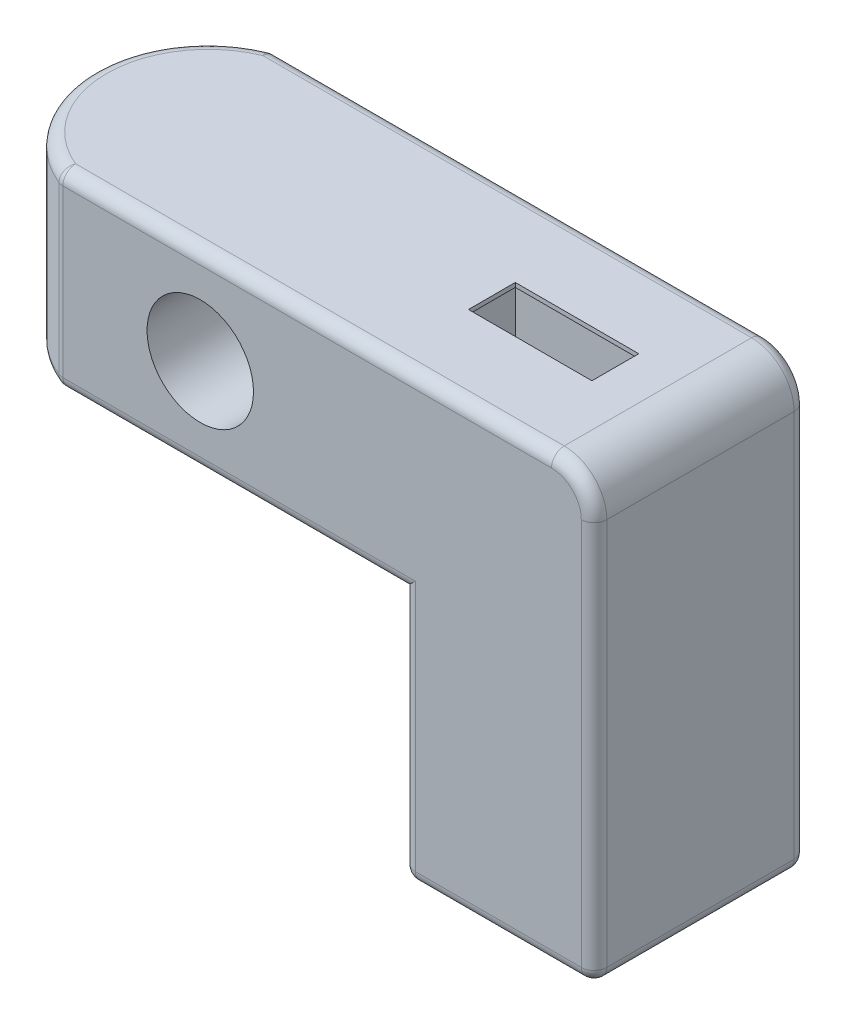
ISO-10303-21;
HEADER;
FILE_DESCRIPTION(('STEP AP214'),'2;1');
FILE_NAME('part.step','',(''),(''),'','','');
FILE_SCHEMA(('AUTOMOTIVE_DESIGN { 1 0 10303 214 1 1 1 1 }'));
ENDSEC;
DATA;
#1=APPLICATION_CONTEXT('core data for automotive mechanical design processes');
#2=APPLICATION_PROTOCOL_DEFINITION('international standard','automotive_design',2000,#1);
#3=PRODUCT_CONTEXT('',#1,'mechanical');
#4=PRODUCT('Part','Part','',(#3));
#5=PRODUCT_RELATED_PRODUCT_CATEGORY('part','',(#4));
#6=PRODUCT_DEFINITION_FORMATION('','',#4);
#7=PRODUCT_DEFINITION_CONTEXT('part definition',#1,'design');
#8=PRODUCT_DEFINITION('design','',#6,#7);
#9=PRODUCT_DEFINITION_SHAPE('','',#8);
#10=(LENGTH_UNIT() NAMED_UNIT(*) SI_UNIT(.MILLI.,.METRE.));
#11=(NAMED_UNIT(*) PLANE_ANGLE_UNIT() SI_UNIT($,.RADIAN.));
#12=(NAMED_UNIT(*) SI_UNIT($,.STERADIAN.) SOLID_ANGLE_UNIT());
#13=UNCERTAINTY_MEASURE_WITH_UNIT(LENGTH_MEASURE(1.E-05),#10,'distance_accuracy_value','');
#14=(GEOMETRIC_REPRESENTATION_CONTEXT(3) GLOBAL_UNCERTAINTY_ASSIGNED_CONTEXT((#13)) GLOBAL_UNIT_ASSIGNED_CONTEXT((#10,
#11,#12)) REPRESENTATION_CONTEXT('',''));
#15=CARTESIAN_POINT('',(0.,0.,0.));
#16=DIRECTION('',(0.,0.,1.));
#17=DIRECTION('',(1.,0.,0.));
#18=AXIS2_PLACEMENT_3D('',#15,#16,#17);
#19=CARTESIAN_POINT('',(-120.,-22.5,-25.));
#20=DIRECTION('',(0.,-1.,0.));
#21=DIRECTION('',(0.,0.,-1.));
#22=AXIS2_PLACEMENT_3D('',#19,#20,#21);
#23=PLANE('',#22);
#24=DIRECTION('',(1.,0.,0.));
#25=VECTOR('',#24,1.);
#26=CARTESIAN_POINT('',(-120.,-22.5,22.));
#27=LINE('',#26,#25);
#28=CARTESIAN_POINT('',(-22.5,-22.5,22.));
#29=VERTEX_POINT('',#28);
#30=CARTESIAN_POINT('',(-102.272161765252,-22.5,22.));
#31=VERTEX_POINT('',#30);
#32=EDGE_CURVE('E423',#29,#31,#27,.F.);
#33=ORIENTED_EDGE('',*,*,#32,.T.);
#34=CARTESIAN_POINT('',(-93.2046130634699,-22.5,0.));
#35=DIRECTION('',(0.,-1.,0.));
#36=DIRECTION('',(0.,0.,-1.));
#37=AXIS2_PLACEMENT_3D('',#34,#35,#36);
#38=CIRCLE('',#37,23.7953869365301);
#39=CARTESIAN_POINT('',(-102.272161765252,-22.5,-22.));
#40=VERTEX_POINT('',#39);
#41=EDGE_CURVE('E528',#31,#40,#38,.T.);
#42=ORIENTED_EDGE('',*,*,#41,.T.);
#43=DIRECTION('',(1.,0.,0.));
#44=VECTOR('',#43,1.);
#45=CARTESIAN_POINT('',(-22.5,-22.5,-22.));
#46=LINE('',#45,#44);
#47=CARTESIAN_POINT('',(-22.5,-22.5,-22.));
#48=VERTEX_POINT('',#47);
#49=EDGE_CURVE('E420',#40,#48,#46,.T.);
#50=ORIENTED_EDGE('',*,*,#49,.T.);
#51=DIRECTION('',(0.,0.,1.));
#52=VECTOR('',#51,1.);
#53=CARTESIAN_POINT('',(-22.5,-22.5,-25.));
#54=LINE('',#53,#52);
#55=EDGE_CURVE('E310',#48,#29,#54,.T.);
#56=ORIENTED_EDGE('',*,*,#55,.T.);
#57=EDGE_LOOP('',(#33,#42,#50,#56));
#58=FACE_BOUND('',#57,.T.);
#59=ADVANCED_FACE('F46',(#58),#23,.T.);
#60=CARTESIAN_POINT('',(22.5,22.5,-25.));
#61=DIRECTION('',(0.,1.,0.));
#62=DIRECTION('',(0.,0.,1.));
#63=AXIS2_PLACEMENT_3D('',#60,#61,#62);
#64=PLANE('',#63);
#65=DIRECTION('',(0.,0.,-1.));
#66=VECTOR('',#65,1.);
#67=CARTESIAN_POINT('',(2.50000000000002,22.5,-5.5));
#68=LINE('',#67,#66);
#69=CARTESIAN_POINT('',(2.50000000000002,22.5,5.5));
#70=VERTEX_POINT('',#69);
#71=CARTESIAN_POINT('',(2.50000000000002,22.5,-5.5));
#72=VERTEX_POINT('',#71);
#73=EDGE_CURVE('E270',#70,#72,#68,.T.);
#74=ORIENTED_EDGE('',*,*,#73,.F.);
#75=DIRECTION('',(1.,0.,0.));
#76=VECTOR('',#75,1.);
#77=CARTESIAN_POINT('',(-26.5,22.5,5.5));
#78=LINE('',#77,#76);
#79=CARTESIAN_POINT('',(-26.5,22.5,5.5));
#80=VERTEX_POINT('',#79);
#81=EDGE_CURVE('E282',#80,#70,#78,.T.);
#82=ORIENTED_EDGE('',*,*,#81,.F.);
#83=DIRECTION('',(0.,0.,1.));
#84=VECTOR('',#83,1.);
#85=CARTESIAN_POINT('',(-26.5,22.5,-5.5));
#86=LINE('',#85,#84);
#87=CARTESIAN_POINT('',(-26.5,22.5,-5.5));
#88=VERTEX_POINT('',#87);
#89=EDGE_CURVE('E278',#88,#80,#86,.T.);
#90=ORIENTED_EDGE('',*,*,#89,.F.);
#91=DIRECTION('',(-1.,0.,0.));
#92=VECTOR('',#91,1.);
#93=CARTESIAN_POINT('',(-26.5,22.5,-5.5));
#94=LINE('',#93,#92);
#95=EDGE_CURVE('E274',#72,#88,#94,.T.);
#96=ORIENTED_EDGE('',*,*,#95,.F.);
#97=EDGE_LOOP('',(#74,#82,#90,#96));
#98=FACE_BOUND('',#97,.T.);
#99=DIRECTION('',(-1.,0.,0.));
#100=VECTOR('',#99,1.);
#101=CARTESIAN_POINT('',(-102.847888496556,22.5,-22.));
#102=LINE('',#101,#100);
#103=CARTESIAN_POINT('',(12.5,22.5,-22.));
#104=VERTEX_POINT('',#103);
#105=CARTESIAN_POINT('',(-102.272161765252,22.5,-22.));
#106=VERTEX_POINT('',#105);
#107=EDGE_CURVE('E430',#104,#106,#102,.T.);
#108=ORIENTED_EDGE('',*,*,#107,.T.);
#109=CARTESIAN_POINT('',(-93.2046130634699,22.5,0.));
#110=DIRECTION('',(0.,1.,0.));
#111=DIRECTION('',(0.,0.,1.));
#112=AXIS2_PLACEMENT_3D('',#109,#110,#111);
#113=CIRCLE('',#112,23.7953869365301);
#114=CARTESIAN_POINT('',(-102.272161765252,22.5,22.));
#115=VERTEX_POINT('',#114);
#116=EDGE_CURVE('E70',#106,#115,#113,.T.);
#117=ORIENTED_EDGE('',*,*,#116,.T.);
#118=DIRECTION('',(-1.,0.,0.));
#119=VECTOR('',#118,1.);
#120=CARTESIAN_POINT('',(22.5,22.5,22.));
#121=LINE('',#120,#119);
#122=CARTESIAN_POINT('',(12.5,22.5,22.));
#123=VERTEX_POINT('',#122);
#124=EDGE_CURVE('E427',#115,#123,#121,.F.);
#125=ORIENTED_EDGE('',*,*,#124,.T.);
#126=DIRECTION('',(0.,0.,1.));
#127=VECTOR('',#126,1.);
#128=CARTESIAN_POINT('',(12.5,22.5,-25.));
#129=LINE('',#128,#127);
#130=EDGE_CURVE('E322',#123,#104,#129,.F.);
#131=ORIENTED_EDGE('',*,*,#130,.T.);
#132=EDGE_LOOP('',(#108,#117,#125,#131));
#133=FACE_BOUND('',#132,.T.);
#134=ADVANCED_FACE('F576',(#98,#133),#64,.T.);
#135=CARTESIAN_POINT('',(-22.5,-22.5,-25.));
#136=DIRECTION('',(-1.,0.,0.));
#137=DIRECTION('',(0.,-1.,0.));
#138=AXIS2_PLACEMENT_3D('',#135,#136,#137);
#139=PLANE('',#138);
#140=DIRECTION('',(0.,0.,1.));
#141=VECTOR('',#140,1.);
#142=CARTESIAN_POINT('',(-22.5,-78.5838135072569,-25.));
#143=LINE('',#142,#141);
#144=CARTESIAN_POINT('',(-22.5,-78.5838135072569,-22.));
#145=VERTEX_POINT('',#144);
#146=CARTESIAN_POINT('',(-22.5,-78.5838135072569,22.));
#147=VERTEX_POINT('',#146);
#148=EDGE_CURVE('E414',#145,#147,#143,.T.);
#149=ORIENTED_EDGE('',*,*,#148,.T.);
#150=DIRECTION('',(0.,-1.,0.));
#151=VECTOR('',#150,1.);
#152=CARTESIAN_POINT('',(-22.5,-22.5,22.));
#153=LINE('',#152,#151);
#154=EDGE_CURVE('E417',#147,#29,#153,.F.);
#155=ORIENTED_EDGE('',*,*,#154,.T.);
#156=ORIENTED_EDGE('',*,*,#55,.F.);
#157=DIRECTION('',(0.,-1.,0.));
#158=VECTOR('',#157,1.);
#159=CARTESIAN_POINT('',(-22.5,-81.5838135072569,-22.));
#160=LINE('',#159,#158);
#161=EDGE_CURVE('E411',#48,#145,#160,.T.);
#162=ORIENTED_EDGE('',*,*,#161,.T.);
#163=EDGE_LOOP('',(#149,#155,#156,#162));
#164=FACE_BOUND('',#163,.T.);
#165=ADVANCED_FACE('F582',(#164),#139,.T.);
#166=CARTESIAN_POINT('',(22.5,-81.5838135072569,-25.));
#167=DIRECTION('',(1.,0.,0.));
#168=DIRECTION('',(0.,0.,-1.));
#169=AXIS2_PLACEMENT_3D('',#166,#167,#168);
#170=PLANE('',#169);
#171=DIRECTION('',(0.,0.,1.));
#172=VECTOR('',#171,1.);
#173=CARTESIAN_POINT('',(22.5,-78.5838135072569,-25.));
#174=LINE('',#173,#172);
#175=CARTESIAN_POINT('',(22.5,-78.5838135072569,22.));
#176=VERTEX_POINT('',#175);
#177=CARTESIAN_POINT('',(22.5,-78.5838135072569,-22.));
#178=VERTEX_POINT('',#177);
#179=EDGE_CURVE('E326',#176,#178,#174,.F.);
#180=ORIENTED_EDGE('',*,*,#179,.T.);
#181=DIRECTION('',(0.,1.,0.));
#182=VECTOR('',#181,1.);
#183=CARTESIAN_POINT('',(22.5,12.5,-22.));
#184=LINE('',#183,#182);
#185=CARTESIAN_POINT('',(22.5,12.5,-22.));
#186=VERTEX_POINT('',#185);
#187=EDGE_CURVE('E332',#178,#186,#184,.T.);
#188=ORIENTED_EDGE('',*,*,#187,.T.);
#189=DIRECTION('',(0.,0.,1.));
#190=VECTOR('',#189,1.);
#191=CARTESIAN_POINT('',(22.5,12.5,-25.));
#192=LINE('',#191,#190);
#193=CARTESIAN_POINT('',(22.5,12.5,22.));
#194=VERTEX_POINT('',#193);
#195=EDGE_CURVE('E318',#186,#194,#192,.T.);
#196=ORIENTED_EDGE('',*,*,#195,.T.);
#197=DIRECTION('',(0.,1.,0.));
#198=VECTOR('',#197,1.);
#199=CARTESIAN_POINT('',(22.5,-81.5838135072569,22.));
#200=LINE('',#199,#198);
#201=EDGE_CURVE('E329',#194,#176,#200,.F.);
#202=ORIENTED_EDGE('',*,*,#201,.T.);
#203=EDGE_LOOP('',(#180,#188,#196,#202));
#204=FACE_BOUND('',#203,.T.);
#205=ADVANCED_FACE('F589',(#204),#170,.T.);
#206=CARTESIAN_POINT('',(-22.5,-81.5838135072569,-25.));
#207=DIRECTION('',(0.,-1.,0.));
#208=DIRECTION('',(0.,0.,-1.));
#209=AXIS2_PLACEMENT_3D('',#206,#207,#208);
#210=PLANE('',#209);
#211=CARTESIAN_POINT('',(0.,-81.5838135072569,0.));
#212=DIRECTION('',(0.,-1.,0.));
#213=DIRECTION('',(0.,0.,-1.));
#214=AXIS2_PLACEMENT_3D('',#211,#212,#213);
#215=CIRCLE('',#214,19.11864057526);
#216=CARTESIAN_POINT('',(0.,-81.5838135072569,-19.11864057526));
#217=VERTEX_POINT('',#216);
#218=EDGE_CURVE('E11',#217,#217,#215,.F.);
#219=ORIENTED_EDGE('',*,*,#218,.T.);
#220=EDGE_LOOP('',(#219));
#221=FACE_BOUND('',#220,.T.);
#222=DIRECTION('',(0.,0.,1.));
#223=VECTOR('',#222,1.);
#224=CARTESIAN_POINT('',(-19.5,-81.5838135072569,-25.));
#225=LINE('',#224,#223);
#226=CARTESIAN_POINT('',(-19.5,-81.5838135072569,22.));
#227=VERTEX_POINT('',#226);
#228=CARTESIAN_POINT('',(-19.5,-81.5838135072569,-22.));
#229=VERTEX_POINT('',#228);
#230=EDGE_CURVE('E401',#227,#229,#225,.F.);
#231=ORIENTED_EDGE('',*,*,#230,.T.);
#232=DIRECTION('',(1.,0.,0.));
#233=VECTOR('',#232,1.);
#234=CARTESIAN_POINT('',(22.5,-81.5838135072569,-22.));
#235=LINE('',#234,#233);
#236=CARTESIAN_POINT('',(19.5,-81.5838135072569,-22.));
#237=VERTEX_POINT('',#236);
#238=EDGE_CURVE('E408',#229,#237,#235,.T.);
#239=ORIENTED_EDGE('',*,*,#238,.T.);
#240=DIRECTION('',(0.,0.,1.));
#241=VECTOR('',#240,1.);
#242=CARTESIAN_POINT('',(19.5,-81.5838135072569,-25.));
#243=LINE('',#242,#241);
#244=CARTESIAN_POINT('',(19.5,-81.5838135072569,22.));
#245=VERTEX_POINT('',#244);
#246=EDGE_CURVE('E404',#237,#245,#243,.T.);
#247=ORIENTED_EDGE('',*,*,#246,.T.);
#248=DIRECTION('',(1.,0.,0.));
#249=VECTOR('',#248,1.);
#250=CARTESIAN_POINT('',(-22.5,-81.5838135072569,22.));
#251=LINE('',#250,#249);
#252=EDGE_CURVE('E398',#245,#227,#251,.F.);
#253=ORIENTED_EDGE('',*,*,#252,.T.);
#254=EDGE_LOOP('',(#231,#239,#247,#253));
#255=FACE_BOUND('',#254,.T.);
#256=ADVANCED_FACE('F592',(#221,#255),#210,.T.);
#257=CARTESIAN_POINT('',(0.,0.,-25.));
#258=DIRECTION('',(0.,0.,1.));
#259=DIRECTION('',(1.,0.,0.));
#260=AXIS2_PLACEMENT_3D('',#257,#258,#259);
#261=PLANE('',#260);
#262=CARTESIAN_POINT('',(-2.49999999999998,-6.50000000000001,-25.));
#263=DIRECTION('',(0.,0.,1.));
#264=DIRECTION('',(1.,0.,0.));
#265=AXIS2_PLACEMENT_3D('',#262,#263,#264);
#266=CIRCLE('',#265,3.);
#267=CARTESIAN_POINT('',(0.500000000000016,-6.50000000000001,-25.));
#268=VERTEX_POINT('',#267);
#269=EDGE_CURVE('E551',#268,#268,#266,.F.);
#270=ORIENTED_EDGE('',*,*,#269,.F.);
#271=EDGE_LOOP('',(#270));
#272=FACE_BOUND('',#271,.T.);
#273=DIRECTION('',(0.,1.,0.));
#274=VECTOR('',#273,1.);
#275=CARTESIAN_POINT('',(19.5,-81.5838135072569,-25.));
#276=LINE('',#275,#274);
#277=CARTESIAN_POINT('',(19.5,12.5,-25.));
#278=VERTEX_POINT('',#277);
#279=CARTESIAN_POINT('',(19.5,-78.5838135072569,-25.));
#280=VERTEX_POINT('',#279);
#281=EDGE_CURVE('E346',#278,#280,#276,.F.);
#282=ORIENTED_EDGE('',*,*,#281,.T.);
#283=DIRECTION('',(1.,0.,0.));
#284=VECTOR('',#283,1.);
#285=CARTESIAN_POINT('',(-22.5,-78.5838135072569,-25.));
#286=LINE('',#285,#284);
#287=CARTESIAN_POINT('',(-19.5,-78.5838135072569,-25.));
#288=VERTEX_POINT('',#287);
#289=EDGE_CURVE('E357',#280,#288,#286,.F.);
#290=ORIENTED_EDGE('',*,*,#289,.T.);
#291=DIRECTION('',(0.,-1.,0.));
#292=VECTOR('',#291,1.);
#293=CARTESIAN_POINT('',(-19.5,-22.5,-25.));
#294=LINE('',#293,#292);
#295=CARTESIAN_POINT('',(-19.5,-19.5,-25.));
#296=VERTEX_POINT('',#295);
#297=EDGE_CURVE('E354',#288,#296,#294,.F.);
#298=ORIENTED_EDGE('',*,*,#297,.T.);
#299=DIRECTION('',(1.,0.,0.));
#300=VECTOR('',#299,1.);
#301=CARTESIAN_POINT('',(-102.847888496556,-19.5,-25.));
#302=LINE('',#301,#300);
#303=CARTESIAN_POINT('',(-102.272161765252,-19.5,-25.));
#304=VERTEX_POINT('',#303);
#305=EDGE_CURVE('E350',#296,#304,#302,.F.);
#306=ORIENTED_EDGE('',*,*,#305,.T.);
#307=DIRECTION('',(0.,1.,0.));
#308=VECTOR('',#307,1.);
#309=CARTESIAN_POINT('',(-102.272161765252,0.,-25.));
#310=LINE('',#309,#308);
#311=CARTESIAN_POINT('',(-102.272161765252,19.5,-25.));
#312=VERTEX_POINT('',#311);
#313=EDGE_CURVE('E339',#304,#312,#310,.T.);
#314=ORIENTED_EDGE('',*,*,#313,.T.);
#315=DIRECTION('',(-1.,0.,0.));
#316=VECTOR('',#315,1.);
#317=CARTESIAN_POINT('',(12.5,19.5,-25.));
#318=LINE('',#317,#316);
#319=CARTESIAN_POINT('',(12.5,19.5,-25.));
#320=VERTEX_POINT('',#319);
#321=EDGE_CURVE('E336',#312,#320,#318,.F.);
#322=ORIENTED_EDGE('',*,*,#321,.T.);
#323=CARTESIAN_POINT('',(12.5,12.5,-25.));
#324=DIRECTION('',(0.,0.,1.));
#325=DIRECTION('',(1.,0.,0.));
#326=AXIS2_PLACEMENT_3D('',#323,#324,#325);
#327=CIRCLE('',#326,7.);
#328=EDGE_CURVE('E343',#320,#278,#327,.F.);
#329=ORIENTED_EDGE('',*,*,#328,.T.);
#330=EDGE_LOOP('',(#282,#290,#298,#306,#314,#322,#329));
#331=FACE_BOUND('',#330,.T.);
#332=CARTESIAN_POINT('',(-70.,0.,-25.));
#333=DIRECTION('',(0.,0.,1.));
#334=DIRECTION('',(1.,0.,0.));
#335=AXIS2_PLACEMENT_3D('',#332,#333,#334);
#336=CIRCLE('',#335,12.5);
#337=CARTESIAN_POINT('',(-57.5,0.,-25.));
#338=VERTEX_POINT('',#337);
#339=EDGE_CURVE('E306',#338,#338,#336,.T.);
#340=ORIENTED_EDGE('',*,*,#339,.T.);
#341=EDGE_LOOP('',(#340));
#342=FACE_BOUND('',#341,.T.);
#343=ADVANCED_FACE('F586',(#272,#331,#342),#261,.F.);
#344=CARTESIAN_POINT('',(-70.,0.,-25.));
#345=DIRECTION('',(0.,0.,1.));
#346=DIRECTION('',(1.,0.,0.));
#347=AXIS2_PLACEMENT_3D('',#344,#345,#346);
#348=CYLINDRICAL_SURFACE('',#347,12.5);
#349=ORIENTED_EDGE('',*,*,#339,.F.);
#350=EDGE_LOOP('',(#349));
#351=FACE_BOUND('',#350,.T.);
#352=CARTESIAN_POINT('',(-70.,0.,25.));
#353=DIRECTION('',(0.,0.,1.));
#354=DIRECTION('',(1.,0.,0.));
#355=AXIS2_PLACEMENT_3D('',#352,#353,#354);
#356=CIRCLE('',#355,12.5);
#357=CARTESIAN_POINT('',(-57.5,0.,25.));
#358=VERTEX_POINT('',#357);
#359=EDGE_CURVE('E302',#358,#358,#356,.T.);
#360=ORIENTED_EDGE('',*,*,#359,.T.);
#361=EDGE_LOOP('',(#360));
#362=FACE_BOUND('',#361,.T.);
#363=ADVANCED_FACE('F786',(#351,#362),#348,.F.);
#364=CARTESIAN_POINT('',(0.,0.,25.));
#365=DIRECTION('',(0.,0.,1.));
#366=DIRECTION('',(1.,0.,0.));
#367=AXIS2_PLACEMENT_3D('',#364,#365,#366);
#368=PLANE('',#367);
#369=DIRECTION('',(0.,-1.,0.));
#370=VECTOR('',#369,1.);
#371=CARTESIAN_POINT('',(-19.5,0.,25.));
#372=LINE('',#371,#370);
#373=CARTESIAN_POINT('',(-19.5,-19.5,25.));
#374=VERTEX_POINT('',#373);
#375=CARTESIAN_POINT('',(-19.5,-78.5838135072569,25.));
#376=VERTEX_POINT('',#375);
#377=EDGE_CURVE('E384',#374,#376,#372,.T.);
#378=ORIENTED_EDGE('',*,*,#377,.T.);
#379=DIRECTION('',(1.,0.,0.));
#380=VECTOR('',#379,1.);
#381=CARTESIAN_POINT('',(0.,-78.5838135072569,25.));
#382=LINE('',#381,#380);
#383=CARTESIAN_POINT('',(19.5,-78.5838135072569,25.));
#384=VERTEX_POINT('',#383);
#385=EDGE_CURVE('E387',#376,#384,#382,.T.);
#386=ORIENTED_EDGE('',*,*,#385,.T.);
#387=DIRECTION('',(0.,1.,0.));
#388=VECTOR('',#387,1.);
#389=CARTESIAN_POINT('',(19.5,0.,25.));
#390=LINE('',#389,#388);
#391=CARTESIAN_POINT('',(19.5,12.5,25.));
#392=VERTEX_POINT('',#391);
#393=EDGE_CURVE('E377',#384,#392,#390,.T.);
#394=ORIENTED_EDGE('',*,*,#393,.T.);
#395=CARTESIAN_POINT('',(12.5,12.5,25.));
#396=DIRECTION('',(0.,0.,1.));
#397=DIRECTION('',(1.,0.,0.));
#398=AXIS2_PLACEMENT_3D('',#395,#396,#397);
#399=CIRCLE('',#398,7.);
#400=CARTESIAN_POINT('',(12.5,19.5,25.));
#401=VERTEX_POINT('',#400);
#402=EDGE_CURVE('E374',#392,#401,#399,.T.);
#403=ORIENTED_EDGE('',*,*,#402,.T.);
#404=DIRECTION('',(-1.,0.,0.));
#405=VECTOR('',#404,1.);
#406=CARTESIAN_POINT('',(0.,19.5,25.));
#407=LINE('',#406,#405);
#408=CARTESIAN_POINT('',(-102.272161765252,19.5,25.));
#409=VERTEX_POINT('',#408);
#410=EDGE_CURVE('E366',#401,#409,#407,.T.);
#411=ORIENTED_EDGE('',*,*,#410,.T.);
#412=DIRECTION('',(0.,-1.,0.));
#413=VECTOR('',#412,1.);
#414=CARTESIAN_POINT('',(-102.272161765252,-22.5,25.));
#415=LINE('',#414,#413);
#416=CARTESIAN_POINT('',(-102.272161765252,-19.5,25.));
#417=VERTEX_POINT('',#416);
#418=EDGE_CURVE('E370',#409,#417,#415,.T.);
#419=ORIENTED_EDGE('',*,*,#418,.T.);
#420=DIRECTION('',(1.,0.,0.));
#421=VECTOR('',#420,1.);
#422=CARTESIAN_POINT('',(0.,-19.5,25.));
#423=LINE('',#422,#421);
#424=EDGE_CURVE('E381',#417,#374,#423,.T.);
#425=ORIENTED_EDGE('',*,*,#424,.T.);
#426=EDGE_LOOP('',(#378,#386,#394,#403,#411,#419,#425));
#427=FACE_BOUND('',#426,.T.);
#428=ORIENTED_EDGE('',*,*,#359,.F.);
#429=EDGE_LOOP('',(#428));
#430=FACE_BOUND('',#429,.T.);
#431=ADVANCED_FACE('F712',(#427,#430),#368,.T.);
#432=CARTESIAN_POINT('',(0.,-31.5838135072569,0.));
#433=DIRECTION('',(0.,-1.,0.));
#434=DIRECTION('',(0.,0.,-1.));
#435=AXIS2_PLACEMENT_3D('',#432,#433,#434);
#436=CYLINDRICAL_SURFACE('',#435,16.1186405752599);
#437=CARTESIAN_POINT('',(0.,-78.5838135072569,0.));
#438=DIRECTION('',(0.,-1.,0.));
#439=DIRECTION('',(0.,0.,-1.));
#440=AXIS2_PLACEMENT_3D('',#437,#438,#439);
#441=CIRCLE('',#440,16.1186405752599);
#442=CARTESIAN_POINT('',(0.,-78.5838135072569,-16.1186405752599));
#443=VERTEX_POINT('',#442);
#444=EDGE_CURVE('E56',#443,#443,#441,.T.);
#445=ORIENTED_EDGE('',*,*,#444,.T.);
#446=EDGE_LOOP('',(#445));
#447=FACE_BOUND('',#446,.T.);
#448=CARTESIAN_POINT('',(0.,-31.5838135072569,0.));
#449=DIRECTION('',(0.,-1.,0.));
#450=DIRECTION('',(0.,0.,-1.));
#451=AXIS2_PLACEMENT_3D('',#448,#449,#450);
#452=CIRCLE('',#451,16.1186405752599);
#453=CARTESIAN_POINT('',(0.,-31.5838135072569,-16.1186405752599));
#454=VERTEX_POINT('',#453);
#455=EDGE_CURVE('E290',#454,#454,#452,.T.);
#456=ORIENTED_EDGE('',*,*,#455,.F.);
#457=EDGE_LOOP('',(#456));
#458=FACE_BOUND('',#457,.T.);
#459=ADVANCED_FACE('F558',(#447,#458),#436,.F.);
#460=CARTESIAN_POINT('',(0.,-31.5838135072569,0.));
#461=DIRECTION('',(0.,-1.,0.));
#462=DIRECTION('',(0.,0.,-1.));
#463=AXIS2_PLACEMENT_3D('',#460,#461,#462);
#464=PLANE('',#463);
#465=CARTESIAN_POINT('',(-2.99999999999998,-31.5838135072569,0.));
#466=DIRECTION('',(0.,-1.,0.));
#467=DIRECTION('',(0.,0.,-1.));
#468=AXIS2_PLACEMENT_3D('',#465,#466,#467);
#469=CIRCLE('',#468,5.5);
#470=CARTESIAN_POINT('',(-2.99999999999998,-31.5838135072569,-5.5));
#471=VERTEX_POINT('',#470);
#472=EDGE_CURVE('E810',#471,#471,#469,.F.);
#473=ORIENTED_EDGE('',*,*,#472,.T.);
#474=EDGE_LOOP('',(#473));
#475=FACE_BOUND('',#474,.T.);
#476=ORIENTED_EDGE('',*,*,#455,.T.);
#477=EDGE_LOOP('',(#476));
#478=FACE_BOUND('',#477,.T.);
#479=ADVANCED_FACE('F778',(#475,#478),#464,.T.);
#480=CARTESIAN_POINT('',(2.50000000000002,-12.5,-5.5));
#481=DIRECTION('',(1.,0.,0.));
#482=DIRECTION('',(0.,0.,-1.));
#483=AXIS2_PLACEMENT_3D('',#480,#481,#482);
#484=PLANE('',#483);
#485=DIRECTION('',(0.,1.,0.));
#486=VECTOR('',#485,1.);
#487=CARTESIAN_POINT('',(2.50000000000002,-12.5,-5.5));
#488=LINE('',#487,#486);
#489=CARTESIAN_POINT('',(2.50000000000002,21.5,-5.5));
#490=VERTEX_POINT('',#489);
#491=EDGE_CURVE('E286',#490,#72,#488,.T.);
#492=ORIENTED_EDGE('',*,*,#491,.F.);
#493=DIRECTION('',(0.,0.,1.));
#494=VECTOR('',#493,1.);
#495=CARTESIAN_POINT('',(2.50000000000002,21.5,-5.5));
#496=LINE('',#495,#494);
#497=CARTESIAN_POINT('',(2.50000000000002,21.5,5.5));
#498=VERTEX_POINT('',#497);
#499=EDGE_CURVE('E266',#490,#498,#496,.T.);
#500=ORIENTED_EDGE('',*,*,#499,.T.);
#501=DIRECTION('',(0.,1.,0.));
#502=VECTOR('',#501,1.);
#503=CARTESIAN_POINT('',(2.50000000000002,-12.5,5.5));
#504=LINE('',#503,#502);
#505=EDGE_CURVE('E287',#498,#70,#504,.T.);
#506=ORIENTED_EDGE('',*,*,#505,.T.);
#507=ORIENTED_EDGE('',*,*,#73,.T.);
#508=EDGE_LOOP('',(#492,#500,#506,#507));
#509=FACE_BOUND('',#508,.T.);
#510=ADVANCED_FACE('F768',(#509),#484,.F.);
#511=CARTESIAN_POINT('',(-26.5,-12.5,5.5));
#512=DIRECTION('',(0.,0.,1.));
#513=DIRECTION('',(1.,0.,0.));
#514=AXIS2_PLACEMENT_3D('',#511,#512,#513);
#515=PLANE('',#514);
#516=ORIENTED_EDGE('',*,*,#505,.F.);
#517=DIRECTION('',(-1.,0.,0.));
#518=VECTOR('',#517,1.);
#519=CARTESIAN_POINT('',(-26.5,21.5,5.5));
#520=LINE('',#519,#518);
#521=CARTESIAN_POINT('',(-26.5,21.5,5.5));
#522=VERTEX_POINT('',#521);
#523=EDGE_CURVE('E257',#498,#522,#520,.T.);
#524=ORIENTED_EDGE('',*,*,#523,.T.);
#525=DIRECTION('',(0.,1.,0.));
#526=VECTOR('',#525,1.);
#527=CARTESIAN_POINT('',(-26.5,-12.5,5.5));
#528=LINE('',#527,#526);
#529=EDGE_CURVE('E291',#522,#80,#528,.T.);
#530=ORIENTED_EDGE('',*,*,#529,.T.);
#531=ORIENTED_EDGE('',*,*,#81,.T.);
#532=EDGE_LOOP('',(#516,#524,#530,#531));
#533=FACE_BOUND('',#532,.T.);
#534=ADVANCED_FACE('F764',(#533),#515,.F.);
#535=CARTESIAN_POINT('',(-26.5,-12.5,-5.5));
#536=DIRECTION('',(-1.,0.,0.));
#537=DIRECTION('',(0.,0.,1.));
#538=AXIS2_PLACEMENT_3D('',#535,#536,#537);
#539=PLANE('',#538);
#540=ORIENTED_EDGE('',*,*,#529,.F.);
#541=DIRECTION('',(0.,0.,-1.));
#542=VECTOR('',#541,1.);
#543=CARTESIAN_POINT('',(-26.5,21.5,-5.5));
#544=LINE('',#543,#542);
#545=CARTESIAN_POINT('',(-26.5,21.5,-5.5));
#546=VERTEX_POINT('',#545);
#547=EDGE_CURVE('E251',#522,#546,#544,.T.);
#548=ORIENTED_EDGE('',*,*,#547,.T.);
#549=DIRECTION('',(0.,1.,0.));
#550=VECTOR('',#549,1.);
#551=CARTESIAN_POINT('',(-26.5,-12.5,-5.5));
#552=LINE('',#551,#550);
#553=EDGE_CURVE('E294',#546,#88,#552,.T.);
#554=ORIENTED_EDGE('',*,*,#553,.T.);
#555=ORIENTED_EDGE('',*,*,#89,.T.);
#556=EDGE_LOOP('',(#540,#548,#554,#555));
#557=FACE_BOUND('',#556,.T.);
#558=ADVANCED_FACE('F767',(#557),#539,.F.);
#559=CARTESIAN_POINT('',(-26.5,-12.5,-5.5));
#560=DIRECTION('',(0.,0.,-1.));
#561=DIRECTION('',(-1.,0.,0.));
#562=AXIS2_PLACEMENT_3D('',#559,#560,#561);
#563=PLANE('',#562);
#564=ORIENTED_EDGE('',*,*,#553,.F.);
#565=DIRECTION('',(1.,0.,0.));
#566=VECTOR('',#565,1.);
#567=CARTESIAN_POINT('',(-26.5,21.5,-5.5));
#568=LINE('',#567,#566);
#569=EDGE_CURVE('E314',#546,#490,#568,.T.);
#570=ORIENTED_EDGE('',*,*,#569,.T.);
#571=ORIENTED_EDGE('',*,*,#491,.T.);
#572=ORIENTED_EDGE('',*,*,#95,.T.);
#573=EDGE_LOOP('',(#564,#570,#571,#572));
#574=FACE_BOUND('',#573,.T.);
#575=ADVANCED_FACE('F748',(#574),#563,.F.);
#576=CARTESIAN_POINT('',(0.,21.5,0.));
#577=DIRECTION('',(0.,1.,0.));
#578=DIRECTION('',(0.,0.,1.));
#579=AXIS2_PLACEMENT_3D('',#576,#577,#578);
#580=PLANE('',#579);
#581=DIRECTION('',(1.,0.,0.));
#582=VECTOR('',#581,1.);
#583=CARTESIAN_POINT('',(-27.5,21.5,6.5));
#584=LINE('',#583,#582);
#585=CARTESIAN_POINT('',(-27.5,21.5,6.5));
#586=VERTEX_POINT('',#585);
#587=CARTESIAN_POINT('',(3.50000000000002,21.5,6.5));
#588=VERTEX_POINT('',#587);
#589=EDGE_CURVE('E228',#586,#588,#584,.T.);
#590=ORIENTED_EDGE('',*,*,#589,.F.);
#591=DIRECTION('',(0.,0.,1.));
#592=VECTOR('',#591,1.);
#593=CARTESIAN_POINT('',(-27.5,21.5,-6.5));
#594=LINE('',#593,#592);
#595=CARTESIAN_POINT('',(-27.5,21.5,-6.5));
#596=VERTEX_POINT('',#595);
#597=EDGE_CURVE('E817',#596,#586,#594,.T.);
#598=ORIENTED_EDGE('',*,*,#597,.F.);
#599=DIRECTION('',(-1.,0.,0.));
#600=VECTOR('',#599,1.);
#601=CARTESIAN_POINT('',(3.50000000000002,21.5,-6.5));
#602=LINE('',#601,#600);
#603=CARTESIAN_POINT('',(3.50000000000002,21.5,-6.5));
#604=VERTEX_POINT('',#603);
#605=EDGE_CURVE('E229',#604,#596,#602,.T.);
#606=ORIENTED_EDGE('',*,*,#605,.F.);
#607=DIRECTION('',(0.,0.,-1.));
#608=VECTOR('',#607,1.);
#609=CARTESIAN_POINT('',(3.50000000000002,21.5,6.5));
#610=LINE('',#609,#608);
#611=EDGE_CURVE('E223',#588,#604,#610,.T.);
#612=ORIENTED_EDGE('',*,*,#611,.F.);
#613=EDGE_LOOP('',(#590,#598,#606,#612));
#614=FACE_BOUND('',#613,.T.);
#615=ORIENTED_EDGE('',*,*,#569,.F.);
#616=ORIENTED_EDGE('',*,*,#547,.F.);
#617=ORIENTED_EDGE('',*,*,#523,.F.);
#618=ORIENTED_EDGE('',*,*,#499,.F.);
#619=EDGE_LOOP('',(#615,#616,#617,#618));
#620=FACE_BOUND('',#619,.T.);
#621=ADVANCED_FACE('F225',(#614,#620),#580,.F.);
#622=CARTESIAN_POINT('',(-27.5,21.5,6.5));
#623=DIRECTION('',(0.,0.,-1.));
#624=DIRECTION('',(-1.,0.,0.));
#625=AXIS2_PLACEMENT_3D('',#622,#623,#624);
#626=PLANE('',#625);
#627=DIRECTION('',(1.,0.,0.));
#628=VECTOR('',#627,1.);
#629=CARTESIAN_POINT('',(-27.5,-12.5,6.5));
#630=LINE('',#629,#628);
#631=CARTESIAN_POINT('',(-27.5,-12.5,6.5));
#632=VERTEX_POINT('',#631);
#633=CARTESIAN_POINT('',(3.50000000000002,-12.5,6.5));
#634=VERTEX_POINT('',#633);
#635=EDGE_CURVE('E813',#632,#634,#630,.T.);
#636=ORIENTED_EDGE('',*,*,#635,.F.);
#637=DIRECTION('',(0.,-1.,0.));
#638=VECTOR('',#637,1.);
#639=CARTESIAN_POINT('',(-27.5,21.5,6.5));
#640=LINE('',#639,#638);
#641=EDGE_CURVE('E244',#586,#632,#640,.T.);
#642=ORIENTED_EDGE('',*,*,#641,.F.);
#643=ORIENTED_EDGE('',*,*,#589,.T.);
#644=DIRECTION('',(0.,-1.,0.));
#645=VECTOR('',#644,1.);
#646=CARTESIAN_POINT('',(3.50000000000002,21.5,6.5));
#647=LINE('',#646,#645);
#648=EDGE_CURVE('E241',#588,#634,#647,.T.);
#649=ORIENTED_EDGE('',*,*,#648,.T.);
#650=EDGE_LOOP('',(#636,#642,#643,#649));
#651=FACE_BOUND('',#650,.T.);
#652=ADVANCED_FACE('F240',(#651),#626,.T.);
#653=CARTESIAN_POINT('',(3.50000000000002,21.5,6.5));
#654=DIRECTION('',(-1.,0.,0.));
#655=DIRECTION('',(0.,0.,1.));
#656=AXIS2_PLACEMENT_3D('',#653,#654,#655);
#657=PLANE('',#656);
#658=DIRECTION('',(0.,0.,-1.));
#659=VECTOR('',#658,1.);
#660=CARTESIAN_POINT('',(3.50000000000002,-12.5,6.5));
#661=LINE('',#660,#659);
#662=CARTESIAN_POINT('',(3.50000000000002,-12.5,-6.5));
#663=VERTEX_POINT('',#662);
#664=EDGE_CURVE('E249',#634,#663,#661,.T.);
#665=ORIENTED_EDGE('',*,*,#664,.F.);
#666=ORIENTED_EDGE('',*,*,#648,.F.);
#667=ORIENTED_EDGE('',*,*,#611,.T.);
#668=DIRECTION('',(0.,-1.,0.));
#669=VECTOR('',#668,1.);
#670=CARTESIAN_POINT('',(3.50000000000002,21.5,-6.5));
#671=LINE('',#670,#669);
#672=EDGE_CURVE('E252',#604,#663,#671,.T.);
#673=ORIENTED_EDGE('',*,*,#672,.T.);
#674=EDGE_LOOP('',(#665,#666,#667,#673));
#675=FACE_BOUND('',#674,.T.);
#676=ADVANCED_FACE('F248',(#675),#657,.T.);
#677=CARTESIAN_POINT('',(3.50000000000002,21.5,-6.5));
#678=DIRECTION('',(0.,0.,1.));
#679=DIRECTION('',(1.,0.,0.));
#680=AXIS2_PLACEMENT_3D('',#677,#678,#679);
#681=PLANE('',#680);
#682=CARTESIAN_POINT('',(-2.49999999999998,-6.50000000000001,-6.5));
#683=DIRECTION('',(0.,0.,1.));
#684=DIRECTION('',(1.,0.,0.));
#685=AXIS2_PLACEMENT_3D('',#682,#683,#684);
#686=CIRCLE('',#685,3.);
#687=CARTESIAN_POINT('',(0.500000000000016,-6.50000000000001,-6.5));
#688=VERTEX_POINT('',#687);
#689=EDGE_CURVE('E801',#688,#688,#686,.T.);
#690=ORIENTED_EDGE('',*,*,#689,.F.);
#691=EDGE_LOOP('',(#690));
#692=FACE_BOUND('',#691,.T.);
#693=DIRECTION('',(-1.,0.,0.));
#694=VECTOR('',#693,1.);
#695=CARTESIAN_POINT('',(3.50000000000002,-12.5,-6.5));
#696=LINE('',#695,#694);
#697=CARTESIAN_POINT('',(-27.5,-12.5,-6.5));
#698=VERTEX_POINT('',#697);
#699=EDGE_CURVE('E824',#663,#698,#696,.T.);
#700=ORIENTED_EDGE('',*,*,#699,.F.);
#701=ORIENTED_EDGE('',*,*,#672,.F.);
#702=ORIENTED_EDGE('',*,*,#605,.T.);
#703=DIRECTION('',(0.,-1.,0.));
#704=VECTOR('',#703,1.);
#705=CARTESIAN_POINT('',(-27.5,21.5,-6.5));
#706=LINE('',#705,#704);
#707=EDGE_CURVE('E259',#596,#698,#706,.T.);
#708=ORIENTED_EDGE('',*,*,#707,.T.);
#709=EDGE_LOOP('',(#700,#701,#702,#708));
#710=FACE_BOUND('',#709,.T.);
#711=ADVANCED_FACE('F752',(#692,#710),#681,.T.);
#712=CARTESIAN_POINT('',(-27.5,21.5,-6.5));
#713=DIRECTION('',(1.,0.,0.));
#714=DIRECTION('',(0.,0.,-1.));
#715=AXIS2_PLACEMENT_3D('',#712,#713,#714);
#716=PLANE('',#715);
#717=DIRECTION('',(0.,0.,1.));
#718=VECTOR('',#717,1.);
#719=CARTESIAN_POINT('',(-27.5,-12.5,-6.5));
#720=LINE('',#719,#718);
#721=EDGE_CURVE('E246',#698,#632,#720,.T.);
#722=ORIENTED_EDGE('',*,*,#721,.F.);
#723=ORIENTED_EDGE('',*,*,#707,.F.);
#724=ORIENTED_EDGE('',*,*,#597,.T.);
#725=ORIENTED_EDGE('',*,*,#641,.T.);
#726=EDGE_LOOP('',(#722,#723,#724,#725));
#727=FACE_BOUND('',#726,.T.);
#728=ADVANCED_FACE('F749',(#727),#716,.T.);
#729=CARTESIAN_POINT('',(0.,-12.5,0.));
#730=DIRECTION('',(0.,1.,0.));
#731=DIRECTION('',(0.,0.,1.));
#732=AXIS2_PLACEMENT_3D('',#729,#730,#731);
#733=PLANE('',#732);
#734=CARTESIAN_POINT('',(-2.99999999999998,-12.5,0.));
#735=DIRECTION('',(0.,1.,0.));
#736=DIRECTION('',(0.,0.,1.));
#737=AXIS2_PLACEMENT_3D('',#734,#735,#736);
#738=CIRCLE('',#737,5.5);
#739=CARTESIAN_POINT('',(-2.99999999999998,-12.5,5.5));
#740=VERTEX_POINT('',#739);
#741=EDGE_CURVE('E503',#740,#740,#738,.T.);
#742=ORIENTED_EDGE('',*,*,#741,.F.);
#743=EDGE_LOOP('',(#742));
#744=FACE_BOUND('',#743,.T.);
#745=ORIENTED_EDGE('',*,*,#635,.T.);
#746=ORIENTED_EDGE('',*,*,#664,.T.);
#747=ORIENTED_EDGE('',*,*,#699,.T.);
#748=ORIENTED_EDGE('',*,*,#721,.T.);
#749=EDGE_LOOP('',(#745,#746,#747,#748));
#750=FACE_BOUND('',#749,.T.);
#751=ADVANCED_FACE('F742',(#744,#750),#733,.T.);
#752=CARTESIAN_POINT('',(-2.99999999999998,-47.140162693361,0.));
#753=DIRECTION('',(0.,1.,0.));
#754=DIRECTION('',(0.,0.,1.));
#755=AXIS2_PLACEMENT_3D('',#752,#753,#754);
#756=CYLINDRICAL_SURFACE('',#755,5.5);
#757=ORIENTED_EDGE('',*,*,#741,.T.);
#758=EDGE_LOOP('',(#757));
#759=FACE_BOUND('',#758,.T.);
#760=ORIENTED_EDGE('',*,*,#472,.F.);
#761=EDGE_LOOP('',(#760));
#762=FACE_BOUND('',#761,.T.);
#763=ADVANCED_FACE('F737',(#759,#762),#756,.F.);
#764=CARTESIAN_POINT('',(-93.2046130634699,-78.4016994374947,0.));
#765=DIRECTION('',(0.,1.,0.));
#766=DIRECTION('',(0.,0.,1.));
#767=AXIS2_PLACEMENT_3D('',#764,#765,#766);
#768=CYLINDRICAL_SURFACE('',#767,26.7953869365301);
#769=DIRECTION('',(0.,1.,0.));
#770=VECTOR('',#769,1.);
#771=CARTESIAN_POINT('',(-103.415351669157,-78.4016994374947,-24.7736468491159));
#772=LINE('',#771,#770);
#773=CARTESIAN_POINT('',(-103.415351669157,19.5,-24.7736468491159));
#774=VERTEX_POINT('',#773);
#775=CARTESIAN_POINT('',(-103.415351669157,-19.5,-24.7736468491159));
#776=VERTEX_POINT('',#775);
#777=EDGE_CURVE('E394',#774,#776,#772,.F.);
#778=ORIENTED_EDGE('',*,*,#777,.T.);
#779=CARTESIAN_POINT('',(-93.2046130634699,-19.5,0.));
#780=DIRECTION('',(0.,-1.,0.));
#781=DIRECTION('',(0.,0.,-1.));
#782=AXIS2_PLACEMENT_3D('',#779,#780,#781);
#783=CIRCLE('',#782,26.7953869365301);
#784=CARTESIAN_POINT('',(-103.415351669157,-19.5,24.7736468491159));
#785=VERTEX_POINT('',#784);
#786=EDGE_CURVE('E534',#776,#785,#783,.F.);
#787=ORIENTED_EDGE('',*,*,#786,.T.);
#788=DIRECTION('',(0.,1.,0.));
#789=VECTOR('',#788,1.);
#790=CARTESIAN_POINT('',(-103.415351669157,-78.4016994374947,24.7736468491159));
#791=LINE('',#790,#789);
#792=CARTESIAN_POINT('',(-103.415351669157,19.5,24.7736468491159));
#793=VERTEX_POINT('',#792);
#794=EDGE_CURVE('E390',#785,#793,#791,.T.);
#795=ORIENTED_EDGE('',*,*,#794,.T.);
#796=CARTESIAN_POINT('',(-93.2046130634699,19.5,0.));
#797=DIRECTION('',(0.,1.,0.));
#798=DIRECTION('',(0.,0.,1.));
#799=AXIS2_PLACEMENT_3D('',#796,#797,#798);
#800=CIRCLE('',#799,26.7953869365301);
#801=EDGE_CURVE('E531',#793,#774,#800,.F.);
#802=ORIENTED_EDGE('',*,*,#801,.T.);
#803=EDGE_LOOP('',(#778,#787,#795,#802));
#804=FACE_BOUND('',#803,.T.);
#805=ADVANCED_FACE('F604',(#804),#768,.T.);
#806=CARTESIAN_POINT('',(12.5,12.5,-25.));
#807=DIRECTION('',(0.,0.,1.));
#808=DIRECTION('',(1.,0.,0.));
#809=AXIS2_PLACEMENT_3D('',#806,#807,#808);
#810=CYLINDRICAL_SURFACE('',#809,10.);
#811=ORIENTED_EDGE('',*,*,#195,.F.);
#812=CARTESIAN_POINT('',(12.5,12.5,-22.));
#813=DIRECTION('',(0.,0.,1.));
#814=DIRECTION('',(1.,0.,0.));
#815=AXIS2_PLACEMENT_3D('',#812,#813,#814);
#816=CIRCLE('',#815,10.);
#817=EDGE_CURVE('E363',#186,#104,#816,.T.);
#818=ORIENTED_EDGE('',*,*,#817,.T.);
#819=ORIENTED_EDGE('',*,*,#130,.F.);
#820=CARTESIAN_POINT('',(12.5,12.5,22.));
#821=DIRECTION('',(0.,0.,1.));
#822=DIRECTION('',(1.,0.,0.));
#823=AXIS2_PLACEMENT_3D('',#820,#821,#822);
#824=CIRCLE('',#823,10.);
#825=EDGE_CURVE('E360',#123,#194,#824,.F.);
#826=ORIENTED_EDGE('',*,*,#825,.T.);
#827=EDGE_LOOP('',(#811,#818,#819,#826));
#828=FACE_BOUND('',#827,.T.);
#829=ADVANCED_FACE('F600',(#828),#810,.T.);
#830=CARTESIAN_POINT('',(0.,-19.5,22.));
#831=DIRECTION('',(1.,0.,0.));
#832=DIRECTION('',(0.,0.,-1.));
#833=AXIS2_PLACEMENT_3D('',#830,#831,#832);
#834=CYLINDRICAL_SURFACE('',#833,3.);
#835=ORIENTED_EDGE('',*,*,#424,.F.);
#836=CARTESIAN_POINT('',(-102.272161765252,-19.5,22.));
#837=DIRECTION('',(1.,0.,0.));
#838=DIRECTION('',(0.,0.,-1.));
#839=AXIS2_PLACEMENT_3D('',#836,#837,#838);
#840=CIRCLE('',#839,3.);
#841=EDGE_CURVE('E510',#417,#31,#840,.T.);
#842=ORIENTED_EDGE('',*,*,#841,.T.);
#843=ORIENTED_EDGE('',*,*,#32,.F.);
#844=CARTESIAN_POINT('',(-19.5,-19.5,22.));
#845=DIRECTION('',(0.707106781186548,-0.707106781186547,0.));
#846=DIRECTION('',(-0.707106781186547,-0.707106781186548,0.));
#847=AXIS2_PLACEMENT_3D('',#844,#845,#846);
#848=ELLIPSE('',#847,4.24264068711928,3.);
#849=EDGE_CURVE('E499',#374,#29,#848,.T.);
#850=ORIENTED_EDGE('',*,*,#849,.F.);
#851=EDGE_LOOP('',(#835,#842,#843,#850));
#852=FACE_BOUND('',#851,.T.);
#853=ADVANCED_FACE('F603',(#852),#834,.T.);
#854=CARTESIAN_POINT('',(-102.272161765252,-78.4016994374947,22.));
#855=DIRECTION('',(0.,1.,0.));
#856=DIRECTION('',(0.,0.,1.));
#857=AXIS2_PLACEMENT_3D('',#854,#855,#856);
#858=CYLINDRICAL_SURFACE('',#857,3.);
#859=ORIENTED_EDGE('',*,*,#794,.F.);
#860=CARTESIAN_POINT('',(-102.272161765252,-19.5,22.));
#861=DIRECTION('',(0.,1.,0.));
#862=DIRECTION('',(0.,0.,1.));
#863=AXIS2_PLACEMENT_3D('',#860,#861,#862);
#864=CIRCLE('',#863,3.);
#865=EDGE_CURVE('E506',#785,#417,#864,.T.);
#866=ORIENTED_EDGE('',*,*,#865,.T.);
#867=ORIENTED_EDGE('',*,*,#418,.F.);
#868=CARTESIAN_POINT('',(-102.272161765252,19.5,22.));
#869=DIRECTION('',(0.,1.,0.));
#870=DIRECTION('',(0.,0.,1.));
#871=AXIS2_PLACEMENT_3D('',#868,#869,#870);
#872=CIRCLE('',#871,3.);
#873=EDGE_CURVE('E433',#409,#793,#872,.F.);
#874=ORIENTED_EDGE('',*,*,#873,.T.);
#875=EDGE_LOOP('',(#859,#866,#867,#874));
#876=FACE_BOUND('',#875,.T.);
#877=ADVANCED_FACE('F677',(#876),#858,.T.);
#878=CARTESIAN_POINT('',(-19.5,0.,22.));
#879=DIRECTION('',(0.,-1.,0.));
#880=DIRECTION('',(1.,0.,0.));
#881=AXIS2_PLACEMENT_3D('',#878,#879,#880);
#882=CYLINDRICAL_SURFACE('',#881,3.);
#883=ORIENTED_EDGE('',*,*,#849,.T.);
#884=ORIENTED_EDGE('',*,*,#154,.F.);
#885=CARTESIAN_POINT('',(-19.5,-78.5838135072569,22.));
#886=DIRECTION('',(0.,-1.,0.));
#887=DIRECTION('',(0.,0.,-1.));
#888=AXIS2_PLACEMENT_3D('',#885,#886,#887);
#889=CIRCLE('',#888,3.);
#890=EDGE_CURVE('E495',#376,#147,#889,.T.);
#891=ORIENTED_EDGE('',*,*,#890,.F.);
#892=ORIENTED_EDGE('',*,*,#377,.F.);
#893=EDGE_LOOP('',(#883,#884,#891,#892));
#894=FACE_BOUND('',#893,.T.);
#895=ADVANCED_FACE('F673',(#894),#882,.T.);
#896=CARTESIAN_POINT('',(0.,19.5,22.));
#897=DIRECTION('',(-1.,0.,0.));
#898=DIRECTION('',(0.,0.,1.));
#899=AXIS2_PLACEMENT_3D('',#896,#897,#898);
#900=CYLINDRICAL_SURFACE('',#899,3.);
#901=ORIENTED_EDGE('',*,*,#124,.F.);
#902=CARTESIAN_POINT('',(-102.272161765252,19.5,22.));
#903=DIRECTION('',(-1.,0.,0.));
#904=DIRECTION('',(0.,0.,1.));
#905=AXIS2_PLACEMENT_3D('',#902,#903,#904);
#906=CIRCLE('',#905,3.);
#907=EDGE_CURVE('E522',#115,#409,#906,.F.);
#908=ORIENTED_EDGE('',*,*,#907,.T.);
#909=ORIENTED_EDGE('',*,*,#410,.F.);
#910=CARTESIAN_POINT('',(12.5,19.5,22.));
#911=DIRECTION('',(1.,0.,0.));
#912=DIRECTION('',(0.,0.,-1.));
#913=AXIS2_PLACEMENT_3D('',#910,#911,#912);
#914=CIRCLE('',#913,3.);
#915=EDGE_CURVE('E491',#123,#401,#914,.T.);
#916=ORIENTED_EDGE('',*,*,#915,.F.);
#917=EDGE_LOOP('',(#901,#908,#909,#916));
#918=FACE_BOUND('',#917,.T.);
#919=ADVANCED_FACE('F669',(#918),#900,.T.);
#920=CARTESIAN_POINT('',(-19.5,-78.5838135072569,22.));
#921=DIRECTION('',(-1.,0.,0.));
#922=DIRECTION('',(0.,0.,1.));
#923=AXIS2_PLACEMENT_3D('',#920,#921,#922);
#924=SPHERICAL_SURFACE('',#923,3.);
#925=CARTESIAN_POINT('',(-19.5,-78.5838135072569,22.));
#926=DIRECTION('',(-1.,0.,0.));
#927=DIRECTION('',(0.,0.,1.));
#928=AXIS2_PLACEMENT_3D('',#925,#926,#927);
#929=CIRCLE('',#928,3.);
#930=EDGE_CURVE('E483',#376,#227,#929,.F.);
#931=ORIENTED_EDGE('',*,*,#930,.F.);
#932=ORIENTED_EDGE('',*,*,#890,.T.);
#933=CARTESIAN_POINT('',(-19.5,-78.5838135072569,22.));
#934=DIRECTION('',(0.,0.,1.));
#935=DIRECTION('',(1.,0.,0.));
#936=AXIS2_PLACEMENT_3D('',#933,#934,#935);
#937=CIRCLE('',#936,3.);
#938=EDGE_CURVE('E487',#227,#147,#937,.F.);
#939=ORIENTED_EDGE('',*,*,#938,.F.);
#940=EDGE_LOOP('',(#931,#932,#939));
#941=FACE_BOUND('',#940,.T.);
#942=ADVANCED_FACE('F665',(#941),#924,.T.);
#943=CARTESIAN_POINT('',(12.5,12.5,22.));
#944=DIRECTION('',(0.,0.,1.));
#945=DIRECTION('',(1.,0.,0.));
#946=AXIS2_PLACEMENT_3D('',#943,#944,#945);
#947=TOROIDAL_SURFACE('',#946,7.,3.);
#948=ORIENTED_EDGE('',*,*,#915,.T.);
#949=ORIENTED_EDGE('',*,*,#402,.F.);
#950=CARTESIAN_POINT('',(19.5,12.5,22.));
#951=DIRECTION('',(0.,-1.,0.));
#952=DIRECTION('',(0.,0.,-1.));
#953=AXIS2_PLACEMENT_3D('',#950,#951,#952);
#954=CIRCLE('',#953,3.);
#955=EDGE_CURVE('E480',#194,#392,#954,.T.);
#956=ORIENTED_EDGE('',*,*,#955,.F.);
#957=ORIENTED_EDGE('',*,*,#825,.F.);
#958=EDGE_LOOP('',(#948,#949,#956,#957));
#959=FACE_BOUND('',#958,.T.);
#960=ADVANCED_FACE('F661',(#959),#947,.T.);
#961=CARTESIAN_POINT('',(-19.5,-22.5,-22.));
#962=DIRECTION('',(0.,1.,0.));
#963=DIRECTION('',(-1.,0.,0.));
#964=AXIS2_PLACEMENT_3D('',#961,#962,#963);
#965=CYLINDRICAL_SURFACE('',#964,3.);
#966=CARTESIAN_POINT('',(-19.5,-78.5838135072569,-22.));
#967=DIRECTION('',(0.,-1.,0.));
#968=DIRECTION('',(0.,0.,-1.));
#969=AXIS2_PLACEMENT_3D('',#966,#967,#968);
#970=CIRCLE('',#969,3.);
#971=EDGE_CURVE('E472',#145,#288,#970,.T.);
#972=ORIENTED_EDGE('',*,*,#971,.F.);
#973=ORIENTED_EDGE('',*,*,#161,.F.);
#974=CARTESIAN_POINT('',(-19.5,-19.5,-22.));
#975=DIRECTION('',(-0.707106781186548,0.707106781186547,0.));
#976=DIRECTION('',(0.707106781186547,0.707106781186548,0.));
#977=AXIS2_PLACEMENT_3D('',#974,#975,#976);
#978=ELLIPSE('',#977,4.24264068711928,3.);
#979=EDGE_CURVE('E476',#296,#48,#978,.T.);
#980=ORIENTED_EDGE('',*,*,#979,.F.);
#981=ORIENTED_EDGE('',*,*,#297,.F.);
#982=EDGE_LOOP('',(#972,#973,#980,#981));
#983=FACE_BOUND('',#982,.T.);
#984=ADVANCED_FACE('F657',(#983),#965,.T.);
#985=CARTESIAN_POINT('',(-19.5,-78.5838135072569,-25.));
#986=DIRECTION('',(0.,0.,1.));
#987=DIRECTION('',(1.,0.,0.));
#988=AXIS2_PLACEMENT_3D('',#985,#986,#987);
#989=CYLINDRICAL_SURFACE('',#988,3.);
#990=ORIENTED_EDGE('',*,*,#938,.T.);
#991=ORIENTED_EDGE('',*,*,#148,.F.);
#992=CARTESIAN_POINT('',(-19.5,-78.5838135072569,-22.));
#993=DIRECTION('',(0.,0.,-1.));
#994=DIRECTION('',(-1.,0.,0.));
#995=AXIS2_PLACEMENT_3D('',#992,#993,#994);
#996=CIRCLE('',#995,3.);
#997=EDGE_CURVE('E468',#229,#145,#996,.T.);
#998=ORIENTED_EDGE('',*,*,#997,.F.);
#999=ORIENTED_EDGE('',*,*,#230,.F.);
#1000=EDGE_LOOP('',(#990,#991,#998,#999));
#1001=FACE_BOUND('',#1000,.T.);
#1002=ADVANCED_FACE('F653',(#1001),#989,.T.);
#1003=CARTESIAN_POINT('',(0.,-78.5838135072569,22.));
#1004=DIRECTION('',(1.,0.,0.));
#1005=DIRECTION('',(0.,0.,-1.));
#1006=AXIS2_PLACEMENT_3D('',#1003,#1004,#1005);
#1007=CYLINDRICAL_SURFACE('',#1006,3.);
#1008=ORIENTED_EDGE('',*,*,#930,.T.);
#1009=ORIENTED_EDGE('',*,*,#252,.F.);
#1010=CARTESIAN_POINT('',(19.5,-78.5838135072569,22.));
#1011=DIRECTION('',(1.,0.,0.));
#1012=DIRECTION('',(0.,1.,0.));
#1013=AXIS2_PLACEMENT_3D('',#1010,#1011,#1012);
#1014=CIRCLE('',#1013,3.);
#1015=EDGE_CURVE('E464',#384,#245,#1014,.T.);
#1016=ORIENTED_EDGE('',*,*,#1015,.F.);
#1017=ORIENTED_EDGE('',*,*,#385,.F.);
#1018=EDGE_LOOP('',(#1008,#1009,#1016,#1017));
#1019=FACE_BOUND('',#1018,.T.);
#1020=ADVANCED_FACE('F649',(#1019),#1007,.T.);
#1021=CARTESIAN_POINT('',(19.5,0.,22.));
#1022=DIRECTION('',(0.,1.,0.));
#1023=DIRECTION('',(0.,0.,1.));
#1024=AXIS2_PLACEMENT_3D('',#1021,#1022,#1023);
#1025=CYLINDRICAL_SURFACE('',#1024,3.);
#1026=ORIENTED_EDGE('',*,*,#955,.T.);
#1027=ORIENTED_EDGE('',*,*,#393,.F.);
#1028=CARTESIAN_POINT('',(19.5,-78.5838135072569,22.));
#1029=DIRECTION('',(0.,-1.,0.));
#1030=DIRECTION('',(0.,0.,-1.));
#1031=AXIS2_PLACEMENT_3D('',#1028,#1029,#1030);
#1032=CIRCLE('',#1031,3.);
#1033=EDGE_CURVE('E460',#176,#384,#1032,.T.);
#1034=ORIENTED_EDGE('',*,*,#1033,.F.);
#1035=ORIENTED_EDGE('',*,*,#201,.F.);
#1036=EDGE_LOOP('',(#1026,#1027,#1034,#1035));
#1037=FACE_BOUND('',#1036,.T.);
#1038=ADVANCED_FACE('F645',(#1037),#1025,.T.);
#1039=CARTESIAN_POINT('',(-120.,-19.5,-22.));
#1040=DIRECTION('',(-1.,0.,0.));
#1041=DIRECTION('',(0.,0.,1.));
#1042=AXIS2_PLACEMENT_3D('',#1039,#1040,#1041);
#1043=CYLINDRICAL_SURFACE('',#1042,3.);
#1044=ORIENTED_EDGE('',*,*,#49,.F.);
#1045=CARTESIAN_POINT('',(-102.272161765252,-19.5,-22.));
#1046=DIRECTION('',(-1.,0.,0.));
#1047=DIRECTION('',(0.,0.,1.));
#1048=AXIS2_PLACEMENT_3D('',#1045,#1046,#1047);
#1049=CIRCLE('',#1048,3.);
#1050=EDGE_CURVE('E519',#40,#304,#1049,.F.);
#1051=ORIENTED_EDGE('',*,*,#1050,.T.);
#1052=ORIENTED_EDGE('',*,*,#305,.F.);
#1053=ORIENTED_EDGE('',*,*,#979,.T.);
#1054=EDGE_LOOP('',(#1044,#1051,#1052,#1053));
#1055=FACE_BOUND('',#1054,.T.);
#1056=ADVANCED_FACE('F641',(#1055),#1043,.T.);
#1057=CARTESIAN_POINT('',(-19.5,-78.5838135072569,-22.));
#1058=DIRECTION('',(-1.,0.,0.));
#1059=DIRECTION('',(0.,0.,1.));
#1060=AXIS2_PLACEMENT_3D('',#1057,#1058,#1059);
#1061=SPHERICAL_SURFACE('',#1060,3.);
#1062=ORIENTED_EDGE('',*,*,#997,.T.);
#1063=ORIENTED_EDGE('',*,*,#971,.T.);
#1064=CARTESIAN_POINT('',(-19.5,-78.5838135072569,-22.));
#1065=DIRECTION('',(-1.,0.,0.));
#1066=DIRECTION('',(0.,0.,1.));
#1067=AXIS2_PLACEMENT_3D('',#1064,#1065,#1066);
#1068=CIRCLE('',#1067,3.);
#1069=EDGE_CURVE('E456',#229,#288,#1068,.F.);
#1070=ORIENTED_EDGE('',*,*,#1069,.F.);
#1071=EDGE_LOOP('',(#1062,#1063,#1070));
#1072=FACE_BOUND('',#1071,.T.);
#1073=ADVANCED_FACE('F637',(#1072),#1061,.T.);
#1074=CARTESIAN_POINT('',(19.5,-78.5838135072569,22.));
#1075=DIRECTION('',(0.,0.,1.));
#1076=DIRECTION('',(1.,0.,0.));
#1077=AXIS2_PLACEMENT_3D('',#1074,#1075,#1076);
#1078=SPHERICAL_SURFACE('',#1077,3.);
#1079=ORIENTED_EDGE('',*,*,#1033,.T.);
#1080=ORIENTED_EDGE('',*,*,#1015,.T.);
#1081=CARTESIAN_POINT('',(19.5,-78.5838135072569,22.));
#1082=DIRECTION('',(0.,0.,1.));
#1083=DIRECTION('',(1.,0.,0.));
#1084=AXIS2_PLACEMENT_3D('',#1081,#1082,#1083);
#1085=CIRCLE('',#1084,3.);
#1086=EDGE_CURVE('E453',#176,#245,#1085,.F.);
#1087=ORIENTED_EDGE('',*,*,#1086,.F.);
#1088=EDGE_LOOP('',(#1079,#1080,#1087));
#1089=FACE_BOUND('',#1088,.T.);
#1090=ADVANCED_FACE('F633',(#1089),#1078,.T.);
#1091=CARTESIAN_POINT('',(-102.272161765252,-78.4016994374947,-22.));
#1092=DIRECTION('',(0.,1.,0.));
#1093=DIRECTION('',(0.,0.,1.));
#1094=AXIS2_PLACEMENT_3D('',#1091,#1092,#1093);
#1095=CYLINDRICAL_SURFACE('',#1094,3.);
#1096=ORIENTED_EDGE('',*,*,#313,.F.);
#1097=CARTESIAN_POINT('',(-102.272161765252,-19.5,-22.));
#1098=DIRECTION('',(0.,1.,0.));
#1099=DIRECTION('',(0.,0.,1.));
#1100=AXIS2_PLACEMENT_3D('',#1097,#1098,#1099);
#1101=CIRCLE('',#1100,3.);
#1102=EDGE_CURVE('E516',#304,#776,#1101,.T.);
#1103=ORIENTED_EDGE('',*,*,#1102,.T.);
#1104=ORIENTED_EDGE('',*,*,#777,.F.);
#1105=CARTESIAN_POINT('',(-102.272161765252,19.5,-22.));
#1106=DIRECTION('',(0.,1.,0.));
#1107=DIRECTION('',(0.,0.,1.));
#1108=AXIS2_PLACEMENT_3D('',#1105,#1106,#1107);
#1109=CIRCLE('',#1108,3.);
#1110=EDGE_CURVE('E513',#774,#312,#1109,.F.);
#1111=ORIENTED_EDGE('',*,*,#1110,.T.);
#1112=EDGE_LOOP('',(#1096,#1103,#1104,#1111));
#1113=FACE_BOUND('',#1112,.T.);
#1114=ADVANCED_FACE('F629',(#1113),#1095,.T.);
#1115=CARTESIAN_POINT('',(-22.5,-78.5838135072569,-22.));
#1116=DIRECTION('',(-1.,0.,0.));
#1117=DIRECTION('',(0.,0.,1.));
#1118=AXIS2_PLACEMENT_3D('',#1115,#1116,#1117);
#1119=CYLINDRICAL_SURFACE('',#1118,3.);
#1120=ORIENTED_EDGE('',*,*,#1069,.T.);
#1121=ORIENTED_EDGE('',*,*,#289,.F.);
#1122=CARTESIAN_POINT('',(19.5,-78.5838135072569,-22.));
#1123=DIRECTION('',(1.,0.,0.));
#1124=DIRECTION('',(0.,0.,-1.));
#1125=AXIS2_PLACEMENT_3D('',#1122,#1123,#1124);
#1126=CIRCLE('',#1125,3.);
#1127=EDGE_CURVE('E449',#237,#280,#1126,.T.);
#1128=ORIENTED_EDGE('',*,*,#1127,.F.);
#1129=ORIENTED_EDGE('',*,*,#238,.F.);
#1130=EDGE_LOOP('',(#1120,#1121,#1128,#1129));
#1131=FACE_BOUND('',#1130,.T.);
#1132=ADVANCED_FACE('F625',(#1131),#1119,.T.);
#1133=CARTESIAN_POINT('',(19.5,-78.5838135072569,-25.));
#1134=DIRECTION('',(0.,0.,1.));
#1135=DIRECTION('',(1.,0.,0.));
#1136=AXIS2_PLACEMENT_3D('',#1133,#1134,#1135);
#1137=CYLINDRICAL_SURFACE('',#1136,3.);
#1138=ORIENTED_EDGE('',*,*,#1086,.T.);
#1139=ORIENTED_EDGE('',*,*,#246,.F.);
#1140=CARTESIAN_POINT('',(19.5,-78.5838135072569,-22.));
#1141=DIRECTION('',(0.,0.,-1.));
#1142=DIRECTION('',(-1.,0.,0.));
#1143=AXIS2_PLACEMENT_3D('',#1140,#1141,#1142);
#1144=CIRCLE('',#1143,3.);
#1145=EDGE_CURVE('E445',#178,#237,#1144,.T.);
#1146=ORIENTED_EDGE('',*,*,#1145,.F.);
#1147=ORIENTED_EDGE('',*,*,#179,.F.);
#1148=EDGE_LOOP('',(#1138,#1139,#1146,#1147));
#1149=FACE_BOUND('',#1148,.T.);
#1150=ADVANCED_FACE('F622',(#1149),#1137,.T.);
#1151=CARTESIAN_POINT('',(22.5,19.5,-22.));
#1152=DIRECTION('',(1.,0.,0.));
#1153=DIRECTION('',(0.,0.,-1.));
#1154=AXIS2_PLACEMENT_3D('',#1151,#1152,#1153);
#1155=CYLINDRICAL_SURFACE('',#1154,3.);
#1156=ORIENTED_EDGE('',*,*,#321,.F.);
#1157=CARTESIAN_POINT('',(-102.272161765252,19.5,-22.));
#1158=DIRECTION('',(1.,0.,0.));
#1159=DIRECTION('',(0.,0.,-1.));
#1160=AXIS2_PLACEMENT_3D('',#1157,#1158,#1159);
#1161=CIRCLE('',#1160,3.);
#1162=EDGE_CURVE('E63',#312,#106,#1161,.T.);
#1163=ORIENTED_EDGE('',*,*,#1162,.T.);
#1164=ORIENTED_EDGE('',*,*,#107,.F.);
#1165=CARTESIAN_POINT('',(12.5,19.5,-22.));
#1166=DIRECTION('',(1.,0.,0.));
#1167=DIRECTION('',(0.,0.,-1.));
#1168=AXIS2_PLACEMENT_3D('',#1165,#1166,#1167);
#1169=CIRCLE('',#1168,3.);
#1170=EDGE_CURVE('E441',#320,#104,#1169,.T.);
#1171=ORIENTED_EDGE('',*,*,#1170,.F.);
#1172=EDGE_LOOP('',(#1156,#1163,#1164,#1171));
#1173=FACE_BOUND('',#1172,.T.);
#1174=ADVANCED_FACE('F618',(#1173),#1155,.T.);
#1175=CARTESIAN_POINT('',(19.5,-78.5838135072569,-22.));
#1176=DIRECTION('',(0.,-1.,0.));
#1177=DIRECTION('',(1.,0.,0.));
#1178=AXIS2_PLACEMENT_3D('',#1175,#1176,#1177);
#1179=SPHERICAL_SURFACE('',#1178,3.);
#1180=ORIENTED_EDGE('',*,*,#1145,.T.);
#1181=ORIENTED_EDGE('',*,*,#1127,.T.);
#1182=CARTESIAN_POINT('',(19.5,-78.5838135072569,-22.));
#1183=DIRECTION('',(0.,-1.,0.));
#1184=DIRECTION('',(0.,0.,-1.));
#1185=AXIS2_PLACEMENT_3D('',#1182,#1183,#1184);
#1186=CIRCLE('',#1185,3.);
#1187=EDGE_CURVE('E437',#178,#280,#1186,.F.);
#1188=ORIENTED_EDGE('',*,*,#1187,.F.);
#1189=EDGE_LOOP('',(#1180,#1181,#1188));
#1190=FACE_BOUND('',#1189,.T.);
#1191=ADVANCED_FACE('F614',(#1190),#1179,.T.);
#1192=CARTESIAN_POINT('',(12.5,12.5,-22.));
#1193=DIRECTION('',(0.,0.,1.));
#1194=DIRECTION('',(1.,0.,0.));
#1195=AXIS2_PLACEMENT_3D('',#1192,#1193,#1194);
#1196=TOROIDAL_SURFACE('',#1195,7.,3.);
#1197=ORIENTED_EDGE('',*,*,#1170,.T.);
#1198=ORIENTED_EDGE('',*,*,#817,.F.);
#1199=CARTESIAN_POINT('',(19.5,12.5,-22.));
#1200=DIRECTION('',(0.,-1.,0.));
#1201=DIRECTION('',(0.,0.,-1.));
#1202=AXIS2_PLACEMENT_3D('',#1199,#1200,#1201);
#1203=CIRCLE('',#1202,3.);
#1204=EDGE_CURVE('E434',#278,#186,#1203,.T.);
#1205=ORIENTED_EDGE('',*,*,#1204,.F.);
#1206=ORIENTED_EDGE('',*,*,#328,.F.);
#1207=EDGE_LOOP('',(#1197,#1198,#1205,#1206));
#1208=FACE_BOUND('',#1207,.T.);
#1209=ADVANCED_FACE('F610',(#1208),#1196,.T.);
#1210=CARTESIAN_POINT('',(19.5,-81.5838135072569,-22.));
#1211=DIRECTION('',(0.,-1.,0.));
#1212=DIRECTION('',(0.,0.,-1.));
#1213=AXIS2_PLACEMENT_3D('',#1210,#1211,#1212);
#1214=CYLINDRICAL_SURFACE('',#1213,3.);
#1215=ORIENTED_EDGE('',*,*,#1187,.T.);
#1216=ORIENTED_EDGE('',*,*,#281,.F.);
#1217=ORIENTED_EDGE('',*,*,#1204,.T.);
#1218=ORIENTED_EDGE('',*,*,#187,.F.);
#1219=EDGE_LOOP('',(#1215,#1216,#1217,#1218));
#1220=FACE_BOUND('',#1219,.T.);
#1221=ADVANCED_FACE('F606',(#1220),#1214,.T.);
#1222=CARTESIAN_POINT('',(-102.272161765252,-19.5,-22.));
#1223=DIRECTION('',(0.,0.,1.));
#1224=DIRECTION('',(1.,0.,0.));
#1225=AXIS2_PLACEMENT_3D('',#1222,#1223,#1224);
#1226=SPHERICAL_SURFACE('',#1225,3.);
#1227=CARTESIAN_POINT('',(-102.272161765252,-19.5,-22.));
#1228=DIRECTION('',(-0.924548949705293,0.,0.381063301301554));
#1229=DIRECTION('',(0.381063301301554,0.,0.924548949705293));
#1230=AXIS2_PLACEMENT_3D('',#1227,#1228,#1229);
#1231=CIRCLE('',#1230,3.);
#1232=EDGE_CURVE('E438',#776,#40,#1231,.T.);
#1233=ORIENTED_EDGE('',*,*,#1232,.F.);
#1234=ORIENTED_EDGE('',*,*,#1102,.F.);
#1235=ORIENTED_EDGE('',*,*,#1050,.F.);
#1236=EDGE_LOOP('',(#1233,#1234,#1235));
#1237=FACE_BOUND('',#1236,.T.);
#1238=ADVANCED_FACE('F609',(#1237),#1226,.T.);
#1239=CARTESIAN_POINT('',(-93.2046130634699,-19.5,0.));
#1240=DIRECTION('',(0.,-1.,0.));
#1241=DIRECTION('',(0.,0.,-1.));
#1242=AXIS2_PLACEMENT_3D('',#1239,#1240,#1241);
#1243=TOROIDAL_SURFACE('',#1242,23.7953869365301,3.);
#1244=CARTESIAN_POINT('',(-102.272161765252,-19.5,22.));
#1245=DIRECTION('',(0.924548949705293,0.,0.381063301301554));
#1246=DIRECTION('',(0.381063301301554,0.,-0.924548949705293));
#1247=AXIS2_PLACEMENT_3D('',#1244,#1245,#1246);
#1248=CIRCLE('',#1247,3.);
#1249=EDGE_CURVE('E539',#785,#31,#1248,.T.);
#1250=ORIENTED_EDGE('',*,*,#1249,.F.);
#1251=ORIENTED_EDGE('',*,*,#786,.F.);
#1252=ORIENTED_EDGE('',*,*,#1232,.T.);
#1253=ORIENTED_EDGE('',*,*,#41,.F.);
#1254=EDGE_LOOP('',(#1250,#1251,#1252,#1253));
#1255=FACE_BOUND('',#1254,.T.);
#1256=ADVANCED_FACE('F689',(#1255),#1243,.T.);
#1257=CARTESIAN_POINT('',(-102.272161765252,-19.5,22.));
#1258=DIRECTION('',(0.,0.,1.));
#1259=DIRECTION('',(1.,0.,0.));
#1260=AXIS2_PLACEMENT_3D('',#1257,#1258,#1259);
#1261=SPHERICAL_SURFACE('',#1260,3.);
#1262=ORIENTED_EDGE('',*,*,#1249,.T.);
#1263=ORIENTED_EDGE('',*,*,#841,.F.);
#1264=ORIENTED_EDGE('',*,*,#865,.F.);
#1265=EDGE_LOOP('',(#1262,#1263,#1264));
#1266=FACE_BOUND('',#1265,.T.);
#1267=ADVANCED_FACE('F685',(#1266),#1261,.T.);
#1268=CARTESIAN_POINT('',(-102.272161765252,19.5,-22.));
#1269=DIRECTION('',(0.,0.,1.));
#1270=DIRECTION('',(1.,0.,0.));
#1271=AXIS2_PLACEMENT_3D('',#1268,#1269,#1270);
#1272=SPHERICAL_SURFACE('',#1271,3.);
#1273=CARTESIAN_POINT('',(-102.272161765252,19.5,-22.));
#1274=DIRECTION('',(-0.924548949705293,0.,0.381063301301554));
#1275=DIRECTION('',(0.381063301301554,0.,0.924548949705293));
#1276=AXIS2_PLACEMENT_3D('',#1273,#1274,#1275);
#1277=CIRCLE('',#1276,3.);
#1278=EDGE_CURVE('E543',#106,#774,#1277,.T.);
#1279=ORIENTED_EDGE('',*,*,#1278,.F.);
#1280=ORIENTED_EDGE('',*,*,#1162,.F.);
#1281=ORIENTED_EDGE('',*,*,#1110,.F.);
#1282=EDGE_LOOP('',(#1279,#1280,#1281));
#1283=FACE_BOUND('',#1282,.T.);
#1284=ADVANCED_FACE('F688',(#1283),#1272,.T.);
#1285=CARTESIAN_POINT('',(-93.2046130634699,19.5,0.));
#1286=DIRECTION('',(0.,1.,0.));
#1287=DIRECTION('',(0.,0.,1.));
#1288=AXIS2_PLACEMENT_3D('',#1285,#1286,#1287);
#1289=TOROIDAL_SURFACE('',#1288,23.7953869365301,3.);
#1290=CARTESIAN_POINT('',(-102.272161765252,19.5,22.));
#1291=DIRECTION('',(0.924548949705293,0.,0.381063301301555));
#1292=DIRECTION('',(0.381063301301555,0.,-0.924548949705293));
#1293=AXIS2_PLACEMENT_3D('',#1290,#1291,#1292);
#1294=CIRCLE('',#1293,3.);
#1295=EDGE_CURVE('E547',#115,#793,#1294,.T.);
#1296=ORIENTED_EDGE('',*,*,#1295,.F.);
#1297=ORIENTED_EDGE('',*,*,#116,.F.);
#1298=ORIENTED_EDGE('',*,*,#1278,.T.);
#1299=ORIENTED_EDGE('',*,*,#801,.F.);
#1300=EDGE_LOOP('',(#1296,#1297,#1298,#1299));
#1301=FACE_BOUND('',#1300,.T.);
#1302=ADVANCED_FACE('F571',(#1301),#1289,.T.);
#1303=CARTESIAN_POINT('',(-102.272161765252,19.5,22.));
#1304=DIRECTION('',(0.,0.,1.));
#1305=DIRECTION('',(1.,0.,0.));
#1306=AXIS2_PLACEMENT_3D('',#1303,#1304,#1305);
#1307=SPHERICAL_SURFACE('',#1306,3.);
#1308=ORIENTED_EDGE('',*,*,#1295,.T.);
#1309=ORIENTED_EDGE('',*,*,#873,.F.);
#1310=ORIENTED_EDGE('',*,*,#907,.F.);
#1311=EDGE_LOOP('',(#1308,#1309,#1310));
#1312=FACE_BOUND('',#1311,.T.);
#1313=ADVANCED_FACE('F563',(#1312),#1307,.T.);
#1314=CARTESIAN_POINT('',(0.,-78.5838135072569,0.));
#1315=DIRECTION('',(0.,-1.,0.));
#1316=DIRECTION('',(0.,0.,-1.));
#1317=AXIS2_PLACEMENT_3D('',#1314,#1315,#1316);
#1318=CONICAL_SURFACE('',#1317,16.1186405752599,0.785398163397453);
#1319=ORIENTED_EDGE('',*,*,#218,.F.);
#1320=EDGE_LOOP('',(#1319));
#1321=FACE_BOUND('',#1320,.T.);
#1322=ORIENTED_EDGE('',*,*,#444,.F.);
#1323=EDGE_LOOP('',(#1322));
#1324=FACE_BOUND('',#1323,.T.);
#1325=ADVANCED_FACE('F49',(#1321,#1324),#1318,.F.);
#1326=CARTESIAN_POINT('',(-2.49999999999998,-6.50000000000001,-33.4852813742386));
#1327=DIRECTION('',(0.,0.,1.));
#1328=DIRECTION('',(1.,0.,0.));
#1329=AXIS2_PLACEMENT_3D('',#1326,#1327,#1328);
#1330=CYLINDRICAL_SURFACE('',#1329,3.);
#1331=ORIENTED_EDGE('',*,*,#269,.T.);
#1332=EDGE_LOOP('',(#1331));
#1333=FACE_BOUND('',#1332,.T.);
#1334=ORIENTED_EDGE('',*,*,#689,.T.);
#1335=EDGE_LOOP('',(#1334));
#1336=FACE_BOUND('',#1335,.T.);
#1337=ADVANCED_FACE('F562',(#1333,#1336),#1330,.F.);
#1338=CLOSED_SHELL('',(#59,#134,#165,#205,#256,#343,#363,#431,#459,#479,#510,#534,#558,#575,
#621,#652,#676,#711,#728,#751,#763,#805,#829,#853,#877,#895,#919,#942,#960,#984,#1002,#1020,
#1038,#1056,#1073,#1090,#1114,#1132,#1150,#1174,#1191,#1209,#1221,#1238,#1256,#1267,#1284,#1302,
#1313,#1325,#1337));
#1339=MANIFOLD_SOLID_BREP('B2',#1338);
#1340=ADVANCED_BREP_SHAPE_REPRESENTATION('',(#18,#1339),#14);
#1341=SHAPE_DEFINITION_REPRESENTATION(#9,#1340);
ENDSEC;
END-ISO-10303-21;
